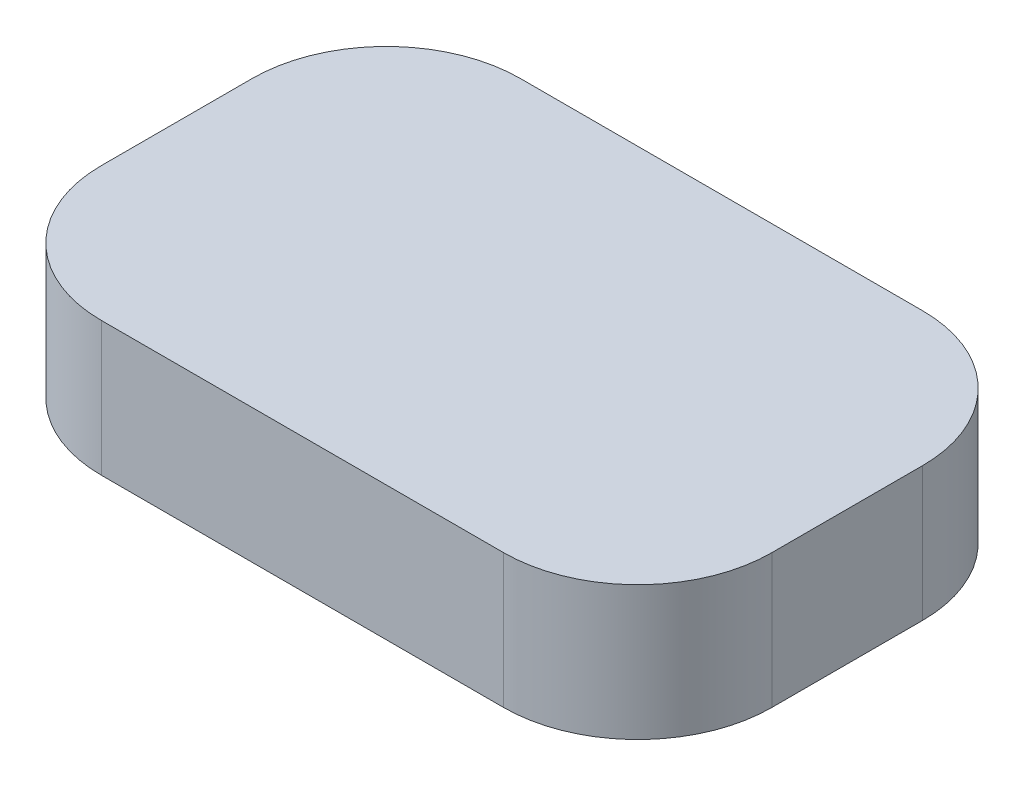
from build123d import *

# Parameters (mm, degrees)
SKETCH1_W      = 200
SKETCH1_H      = 125
EXTRUDE1_DEPTH = 40
FILLET1_R      = 40


with BuildPart() as part:
    # Sketch1 → Extrude1 (new body)
    with BuildSketch(Plane(origin=(0, 0, 0), x_dir=(1, 0, 0), z_dir=(0, 1, 0))):
        Rectangle(SKETCH1_W, SKETCH1_H)
    extrude(amount=EXTRUDE1_DEPTH)

    # Fillet1
    fillet1_edges = [part.edges().sort_by_distance(p)[0] for p in [
        (-100, 20, -62.5),
        (100, 20, -62.5),
        (100, 20, 62.5),
        (-100, 20, 62.5),
    ]]
    fillet(fillet1_edges, radius=FILLET1_R)


solid = part.part
